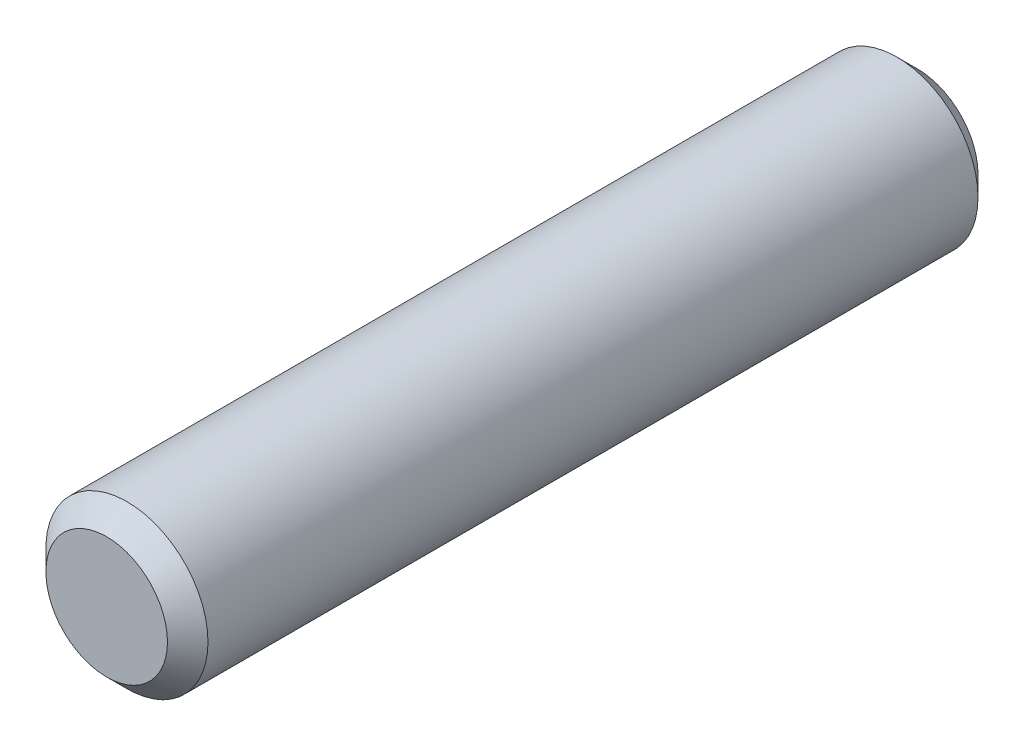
from build123d import *

# Parameters (mm, degrees)
ESQUISSE1_R          = 4
BASE_EXTRUSION_DEPTH = 40
CHANFREIN2_SIZE      = 1


with BuildPart() as part:
    # Esquisse1 → Base-Extrusion (new body)
    with BuildSketch(Plane.XY):
        Circle(ESQUISSE1_R)
    extrude(amount=BASE_EXTRUSION_DEPTH)

    # Chanfrein2
    chanfrein2_edges = [part.edges().sort_by_distance(p)[0] for p in [
        (-4, 0, 0),
        (-4, 0, 40),
    ]]
    chamfer(chanfrein2_edges, length=CHANFREIN2_SIZE)


solid = part.part
